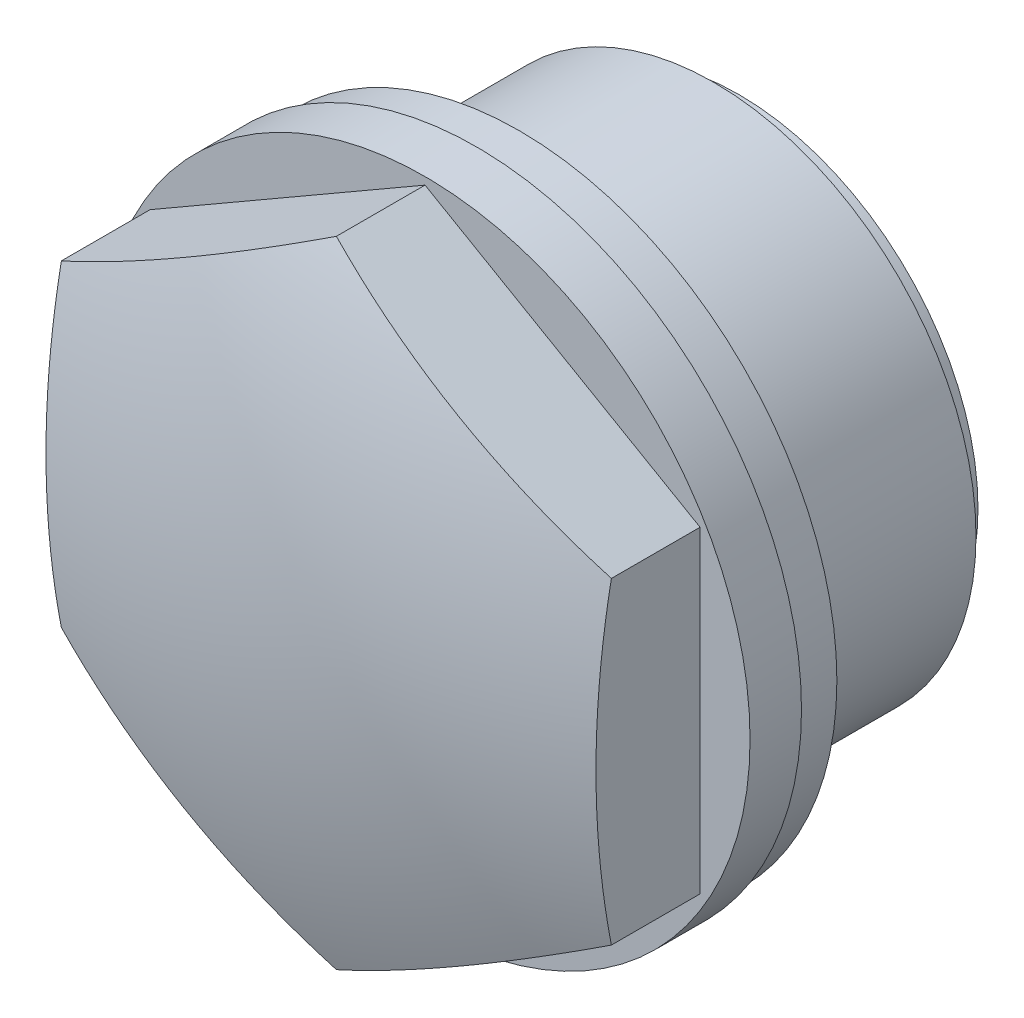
ISO-10303-21;
HEADER;
FILE_DESCRIPTION(('STEP AP214'),'2;1');
FILE_NAME('part.step','',(''),(''),'','','');
FILE_SCHEMA(('AUTOMOTIVE_DESIGN { 1 0 10303 214 1 1 1 1 }'));
ENDSEC;
DATA;
#1=APPLICATION_CONTEXT('core data for automotive mechanical design processes');
#2=APPLICATION_PROTOCOL_DEFINITION('international standard','automotive_design',2000,#1);
#3=PRODUCT_CONTEXT('',#1,'mechanical');
#4=PRODUCT('Part','Part','',(#3));
#5=PRODUCT_RELATED_PRODUCT_CATEGORY('part','',(#4));
#6=PRODUCT_DEFINITION_FORMATION('','',#4);
#7=PRODUCT_DEFINITION_CONTEXT('part definition',#1,'design');
#8=PRODUCT_DEFINITION('design','',#6,#7);
#9=PRODUCT_DEFINITION_SHAPE('','',#8);
#10=(LENGTH_UNIT() NAMED_UNIT(*) SI_UNIT(.MILLI.,.METRE.));
#11=(NAMED_UNIT(*) PLANE_ANGLE_UNIT() SI_UNIT($,.RADIAN.));
#12=(NAMED_UNIT(*) SI_UNIT($,.STERADIAN.) SOLID_ANGLE_UNIT());
#13=UNCERTAINTY_MEASURE_WITH_UNIT(LENGTH_MEASURE(1.E-05),#10,'distance_accuracy_value','');
#14=(GEOMETRIC_REPRESENTATION_CONTEXT(3) GLOBAL_UNCERTAINTY_ASSIGNED_CONTEXT((#13)) GLOBAL_UNIT_ASSIGNED_CONTEXT((#10,
#11,#12)) REPRESENTATION_CONTEXT('',''));
#15=CARTESIAN_POINT('',(0.,0.,0.));
#16=DIRECTION('',(0.,0.,1.));
#17=DIRECTION('',(1.,0.,0.));
#18=AXIS2_PLACEMENT_3D('',#15,#16,#17);
#19=CARTESIAN_POINT('',(0.,0.,9.715));
#20=DIRECTION('',(0.,0.,1.));
#21=DIRECTION('',(1.,0.,0.));
#22=AXIS2_PLACEMENT_3D('',#19,#20,#21);
#23=CYLINDRICAL_SURFACE('',#22,13.);
#24=CARTESIAN_POINT('',(0.,0.,3.77261316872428));
#25=DIRECTION('',(0.,0.,1.));
#26=DIRECTION('',(1.,0.,0.));
#27=AXIS2_PLACEMENT_3D('',#24,#25,#26);
#28=CIRCLE('',#27,13.);
#29=CARTESIAN_POINT('',(13.,0.,3.77261316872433));
#30=VERTEX_POINT('',#29);
#31=EDGE_CURVE('E141',#30,#30,#28,.T.);
#32=ORIENTED_EDGE('',*,*,#31,.F.);
#33=EDGE_LOOP('',(#32));
#34=FACE_BOUND('',#33,.T.);
#35=CARTESIAN_POINT('',(0.,0.,1.715));
#36=DIRECTION('',(0.,0.,1.));
#37=DIRECTION('',(1.,0.,0.));
#38=AXIS2_PLACEMENT_3D('',#35,#36,#37);
#39=CIRCLE('',#38,13.);
#40=CARTESIAN_POINT('',(13.,0.,1.71500000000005));
#41=VERTEX_POINT('',#40);
#42=EDGE_CURVE('E109',#41,#41,#39,.T.);
#43=ORIENTED_EDGE('',*,*,#42,.T.);
#44=EDGE_LOOP('',(#43));
#45=FACE_BOUND('',#44,.T.);
#46=ADVANCED_FACE('F14',(#34,#45),#23,.T.);
#47=CARTESIAN_POINT('',(0.,1.06685493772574E-13,-27.1509999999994));
#48=DIRECTION('',(0.,0.,1.));
#49=DIRECTION('',(0.,-1.,0.));
#50=AXIS2_PLACEMENT_3D('',#47,#48,#49);
#51=SPHERICAL_SURFACE('',#50,34.8659999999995);
#52=CARTESIAN_POINT('',(0.,0.,6.9417508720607));
#53=DIRECTION('',(0.,0.,1.));
#54=DIRECTION('',(1.,0.,0.));
#55=AXIS2_PLACEMENT_3D('',#52,#53,#54);
#56=CIRCLE('',#55,7.30221158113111);
#57=CARTESIAN_POINT('',(7.30221158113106,0.,6.94175087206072));
#58=VERTEX_POINT('',#57);
#59=EDGE_CURVE('E133',#58,#58,#56,.T.);
#60=ORIENTED_EDGE('',*,*,#59,.F.);
#61=EDGE_LOOP('',(#60));
#62=FACE_BOUND('',#61,.T.);
#63=ADVANCED_FACE('F16',(#62),#51,.F.);
#64=CARTESIAN_POINT('',(0.,0.,6.9417508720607));
#65=DIRECTION('',(0.,0.,-1.));
#66=DIRECTION('',(-1.,0.,0.));
#67=AXIS2_PLACEMENT_3D('',#64,#65,#66);
#68=CONICAL_SURFACE('',#67,7.30221158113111,0.0349065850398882);
#69=CARTESIAN_POINT('',(0.,0.,-8.785));
#70=DIRECTION('',(0.,0.,1.));
#71=DIRECTION('',(1.,0.,0.));
#72=AXIS2_PLACEMENT_3D('',#69,#70,#71);
#73=CIRCLE('',#72,7.85140182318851);
#74=CARTESIAN_POINT('',(7.85140182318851,0.,-8.78499999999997));
#75=VERTEX_POINT('',#74);
#76=EDGE_CURVE('E130',#75,#75,#73,.T.);
#77=ORIENTED_EDGE('',*,*,#76,.F.);
#78=EDGE_LOOP('',(#77));
#79=FACE_BOUND('',#78,.T.);
#80=ORIENTED_EDGE('',*,*,#59,.T.);
#81=EDGE_LOOP('',(#80));
#82=FACE_BOUND('',#81,.T.);
#83=ADVANCED_FACE('F172',(#79,#82),#68,.F.);
#84=CARTESIAN_POINT('',(0.,7.85140182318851,-8.785));
#85=DIRECTION('',(0.,0.,1.));
#86=DIRECTION('',(1.,0.,0.));
#87=AXIS2_PLACEMENT_3D('',#84,#85,#86);
#88=PLANE('',#87);
#89=CARTESIAN_POINT('',(0.,0.,-8.785));
#90=DIRECTION('',(0.,0.,1.));
#91=DIRECTION('',(1.,0.,0.));
#92=AXIS2_PLACEMENT_3D('',#89,#90,#91);
#93=CIRCLE('',#92,9.5598475);
#94=CARTESIAN_POINT('',(9.5598475,0.,-8.78499999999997));
#95=VERTEX_POINT('',#94);
#96=EDGE_CURVE('E127',#95,#95,#93,.T.);
#97=ORIENTED_EDGE('',*,*,#96,.F.);
#98=EDGE_LOOP('',(#97));
#99=FACE_BOUND('',#98,.T.);
#100=ORIENTED_EDGE('',*,*,#76,.T.);
#101=EDGE_LOOP('',(#100));
#102=FACE_BOUND('',#101,.T.);
#103=ADVANCED_FACE('F202',(#99,#102),#88,.F.);
#104=CARTESIAN_POINT('',(0.,0.,9.715));
#105=DIRECTION('',(0.,0.,1.));
#106=DIRECTION('',(1.,0.,0.));
#107=AXIS2_PLACEMENT_3D('',#104,#105,#106);
#108=CYLINDRICAL_SURFACE('',#107,9.5598475);
#109=CARTESIAN_POINT('',(0.,0.,-7.785));
#110=DIRECTION('',(0.,0.,1.));
#111=DIRECTION('',(1.,0.,0.));
#112=AXIS2_PLACEMENT_3D('',#109,#110,#111);
#113=CIRCLE('',#112,9.5598475);
#114=CARTESIAN_POINT('',(9.5598475,0.,-7.78499999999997));
#115=VERTEX_POINT('',#114);
#116=EDGE_CURVE('E124',#115,#115,#113,.T.);
#117=ORIENTED_EDGE('',*,*,#116,.F.);
#118=EDGE_LOOP('',(#117));
#119=FACE_BOUND('',#118,.T.);
#120=ORIENTED_EDGE('',*,*,#96,.T.);
#121=EDGE_LOOP('',(#120));
#122=FACE_BOUND('',#121,.T.);
#123=ADVANCED_FACE('F198',(#119,#122),#108,.T.);
#124=CARTESIAN_POINT('',(0.,9.5598475,-7.785));
#125=DIRECTION('',(0.,0.,1.));
#126=DIRECTION('',(1.,0.,0.));
#127=AXIS2_PLACEMENT_3D('',#124,#125,#126);
#128=PLANE('',#127);
#129=CARTESIAN_POINT('',(0.,0.,-7.785));
#130=DIRECTION('',(0.,0.,1.));
#131=DIRECTION('',(1.,0.,0.));
#132=AXIS2_PLACEMENT_3D('',#129,#130,#131);
#133=CIRCLE('',#132,10.48);
#134=CARTESIAN_POINT('',(10.48,0.,-7.78499999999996));
#135=VERTEX_POINT('',#134);
#136=EDGE_CURVE('E121',#135,#135,#133,.T.);
#137=ORIENTED_EDGE('',*,*,#136,.F.);
#138=EDGE_LOOP('',(#137));
#139=FACE_BOUND('',#138,.T.);
#140=ORIENTED_EDGE('',*,*,#116,.T.);
#141=EDGE_LOOP('',(#140));
#142=FACE_BOUND('',#141,.T.);
#143=ADVANCED_FACE('F194',(#139,#142),#128,.F.);
#144=CARTESIAN_POINT('',(0.,0.,9.715));
#145=DIRECTION('',(0.,0.,1.));
#146=DIRECTION('',(1.,0.,0.));
#147=AXIS2_PLACEMENT_3D('',#144,#145,#146);
#148=CYLINDRICAL_SURFACE('',#147,10.48);
#149=CARTESIAN_POINT('',(0.,0.,0.000469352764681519));
#150=DIRECTION('',(0.,0.,1.));
#151=DIRECTION('',(1.,0.,0.));
#152=AXIS2_PLACEMENT_3D('',#149,#150,#151);
#153=CIRCLE('',#152,10.48);
#154=CARTESIAN_POINT('',(10.48,0.,0.00046935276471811));
#155=VERTEX_POINT('',#154);
#156=EDGE_CURVE('E118',#155,#155,#153,.T.);
#157=ORIENTED_EDGE('',*,*,#156,.F.);
#158=EDGE_LOOP('',(#157));
#159=FACE_BOUND('',#158,.T.);
#160=ORIENTED_EDGE('',*,*,#136,.T.);
#161=EDGE_LOOP('',(#160));
#162=FACE_BOUND('',#161,.T.);
#163=ADVANCED_FACE('F190',(#159,#162),#148,.T.);
#164=CARTESIAN_POINT('',(0.,10.48,0.000469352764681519));
#165=DIRECTION('',(0.,0.,1.));
#166=DIRECTION('',(1.,0.,0.));
#167=AXIS2_PLACEMENT_3D('',#164,#165,#166);
#168=PLANE('',#167);
#169=CARTESIAN_POINT('',(0.,0.,0.000469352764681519));
#170=DIRECTION('',(0.,0.,1.));
#171=DIRECTION('',(1.,0.,0.));
#172=AXIS2_PLACEMENT_3D('',#169,#170,#171);
#173=CIRCLE('',#172,12.701);
#174=CARTESIAN_POINT('',(12.701,0.,0.000469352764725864));
#175=VERTEX_POINT('',#174);
#176=EDGE_CURVE('E115',#175,#175,#173,.T.);
#177=ORIENTED_EDGE('',*,*,#176,.F.);
#178=EDGE_LOOP('',(#177));
#179=FACE_BOUND('',#178,.T.);
#180=ORIENTED_EDGE('',*,*,#156,.T.);
#181=EDGE_LOOP('',(#180));
#182=FACE_BOUND('',#181,.T.);
#183=ADVANCED_FACE('F186',(#179,#182),#168,.F.);
#184=CARTESIAN_POINT('',(0.,0.,9.715));
#185=DIRECTION('',(0.,0.,1.));
#186=DIRECTION('',(1.,0.,0.));
#187=AXIS2_PLACEMENT_3D('',#184,#185,#186);
#188=CYLINDRICAL_SURFACE('',#187,12.701);
#189=CARTESIAN_POINT('',(0.,0.,1.715));
#190=DIRECTION('',(0.,0.,1.));
#191=DIRECTION('',(1.,0.,0.));
#192=AXIS2_PLACEMENT_3D('',#189,#190,#191);
#193=CIRCLE('',#192,12.701);
#194=CARTESIAN_POINT('',(12.701,0.,1.71500000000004));
#195=VERTEX_POINT('',#194);
#196=EDGE_CURVE('E112',#195,#195,#193,.T.);
#197=ORIENTED_EDGE('',*,*,#196,.F.);
#198=EDGE_LOOP('',(#197));
#199=FACE_BOUND('',#198,.T.);
#200=ORIENTED_EDGE('',*,*,#176,.T.);
#201=EDGE_LOOP('',(#200));
#202=FACE_BOUND('',#201,.T.);
#203=ADVANCED_FACE('F182',(#199,#202),#188,.T.);
#204=CARTESIAN_POINT('',(0.,12.701,1.715));
#205=DIRECTION('',(0.,0.,1.));
#206=DIRECTION('',(1.,0.,0.));
#207=AXIS2_PLACEMENT_3D('',#204,#205,#206);
#208=PLANE('',#207);
#209=ORIENTED_EDGE('',*,*,#42,.F.);
#210=EDGE_LOOP('',(#209));
#211=FACE_BOUND('',#210,.T.);
#212=ORIENTED_EDGE('',*,*,#196,.T.);
#213=EDGE_LOOP('',(#212));
#214=FACE_BOUND('',#213,.T.);
#215=ADVANCED_FACE('F179',(#211,#214),#208,.F.);
#216=CARTESIAN_POINT('',(0.,0.,-25.151));
#217=DIRECTION('',(0.,0.,1.));
#218=DIRECTION('',(0.,1.,0.));
#219=AXIS2_PLACEMENT_3D('',#216,#217,#218);
#220=SPHERICAL_SURFACE('',#219,34.866);
#221=CARTESIAN_POINT('',(5.5,9.52627944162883,-25.151));
#222=DIRECTION('',(-0.5,-0.866025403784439,0.));
#223=DIRECTION('',(0.866025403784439,-0.5,0.));
#224=AXIS2_PLACEMENT_3D('',#221,#222,#223);
#225=CIRCLE('',#224,33.0853132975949);
#226=CARTESIAN_POINT('',(0.,12.7017059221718,7.3190573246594));
#227=VERTEX_POINT('',#226);
#228=CARTESIAN_POINT('',(11.,6.3508529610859,7.31905732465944));
#229=VERTEX_POINT('',#228);
#230=EDGE_CURVE('E85',#227,#229,#225,.F.);
#231=ORIENTED_EDGE('',*,*,#230,.F.);
#232=CARTESIAN_POINT('',(-5.49999999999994,9.52627944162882,-25.151));
#233=DIRECTION('',(0.5,-0.866025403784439,0.));
#234=DIRECTION('',(0.866025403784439,0.5,0.));
#235=AXIS2_PLACEMENT_3D('',#232,#233,#234);
#236=CIRCLE('',#235,33.0853132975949);
#237=CARTESIAN_POINT('',(-11.,6.35085296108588,7.31905732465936));
#238=VERTEX_POINT('',#237);
#239=EDGE_CURVE('E136',#238,#227,#236,.F.);
#240=ORIENTED_EDGE('',*,*,#239,.F.);
#241=CARTESIAN_POINT('',(-11.,0.,-25.151));
#242=DIRECTION('',(1.,0.,0.));
#243=DIRECTION('',(0.,0.,-1.));
#244=AXIS2_PLACEMENT_3D('',#241,#242,#243);
#245=CIRCLE('',#244,33.0853132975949);
#246=CARTESIAN_POINT('',(-11.,-6.35085296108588,7.31905732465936));
#247=VERTEX_POINT('',#246);
#248=EDGE_CURVE('E36',#247,#238,#245,.F.);
#249=ORIENTED_EDGE('',*,*,#248,.F.);
#250=CARTESIAN_POINT('',(-5.49999999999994,-9.52627944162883,-25.151));
#251=DIRECTION('',(0.5,0.866025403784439,0.));
#252=DIRECTION('',(-0.866025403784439,0.5,0.));
#253=AXIS2_PLACEMENT_3D('',#250,#251,#252);
#254=CIRCLE('',#253,33.0853132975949);
#255=CARTESIAN_POINT('',(0.,-12.7017059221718,7.3190573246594));
#256=VERTEX_POINT('',#255);
#257=EDGE_CURVE('E29',#256,#247,#254,.F.);
#258=ORIENTED_EDGE('',*,*,#257,.F.);
#259=CARTESIAN_POINT('',(5.5,-9.52627944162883,-25.151));
#260=DIRECTION('',(-0.5,0.866025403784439,0.));
#261=DIRECTION('',(-0.866025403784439,-0.5,0.));
#262=AXIS2_PLACEMENT_3D('',#259,#260,#261);
#263=CIRCLE('',#262,33.0853132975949);
#264=CARTESIAN_POINT('',(11.,-6.35085296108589,7.31905732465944));
#265=VERTEX_POINT('',#264);
#266=EDGE_CURVE('E98',#265,#256,#263,.F.);
#267=ORIENTED_EDGE('',*,*,#266,.F.);
#268=CARTESIAN_POINT('',(11.,0.,-25.151));
#269=DIRECTION('',(-1.,0.,0.));
#270=DIRECTION('',(0.,0.,1.));
#271=AXIS2_PLACEMENT_3D('',#268,#269,#270);
#272=CIRCLE('',#271,33.0853132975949);
#273=EDGE_CURVE('E9',#229,#265,#272,.F.);
#274=ORIENTED_EDGE('',*,*,#273,.F.);
#275=EDGE_LOOP('',(#231,#240,#249,#258,#267,#274));
#276=FACE_BOUND('',#275,.T.);
#277=ADVANCED_FACE('F150',(#276),#220,.T.);
#278=CARTESIAN_POINT('',(0.,0.,3.77261316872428));
#279=DIRECTION('',(0.,0.,1.));
#280=DIRECTION('',(1.,0.,0.));
#281=AXIS2_PLACEMENT_3D('',#278,#279,#280);
#282=PLANE('',#281);
#283=ORIENTED_EDGE('',*,*,#31,.T.);
#284=EDGE_LOOP('',(#283));
#285=FACE_BOUND('',#284,.T.);
#286=DIRECTION('',(0.866025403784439,0.5,0.));
#287=VECTOR('',#286,1.);
#288=CARTESIAN_POINT('',(-11.,6.35085296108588,3.77261316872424));
#289=LINE('',#288,#287);
#290=CARTESIAN_POINT('',(-11.,6.35085296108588,3.77261316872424));
#291=VERTEX_POINT('',#290);
#292=CARTESIAN_POINT('',(0.,12.7017059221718,3.77261316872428));
#293=VERTEX_POINT('',#292);
#294=EDGE_CURVE('E77',#291,#293,#289,.T.);
#295=ORIENTED_EDGE('',*,*,#294,.T.);
#296=DIRECTION('',(0.866025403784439,-0.5,0.));
#297=VECTOR('',#296,1.);
#298=CARTESIAN_POINT('',(-0.100000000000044,12.7594409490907,3.77261316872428));
#299=LINE('',#298,#297);
#300=CARTESIAN_POINT('',(11.,6.3508529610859,3.77261316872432));
#301=VERTEX_POINT('',#300);
#302=EDGE_CURVE('E68',#293,#301,#299,.T.);
#303=ORIENTED_EDGE('',*,*,#302,.T.);
#304=DIRECTION('',(0.,-1.,0.));
#305=VECTOR('',#304,1.);
#306=CARTESIAN_POINT('',(11.,6.3508529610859,3.77261316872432));
#307=LINE('',#306,#305);
#308=CARTESIAN_POINT('',(11.,-6.35085296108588,3.77261316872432));
#309=VERTEX_POINT('',#308);
#310=EDGE_CURVE('E73',#301,#309,#307,.T.);
#311=ORIENTED_EDGE('',*,*,#310,.T.);
#312=DIRECTION('',(-0.866025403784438,-0.5,0.));
#313=VECTOR('',#312,1.);
#314=CARTESIAN_POINT('',(11.,-6.35085296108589,3.77261316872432));
#315=LINE('',#314,#313);
#316=CARTESIAN_POINT('',(0.,-12.7017059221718,3.77261316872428));
#317=VERTEX_POINT('',#316);
#318=EDGE_CURVE('E92',#309,#317,#315,.T.);
#319=ORIENTED_EDGE('',*,*,#318,.T.);
#320=DIRECTION('',(-0.866025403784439,0.5,0.));
#321=VECTOR('',#320,1.);
#322=CARTESIAN_POINT('',(0.0999999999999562,-12.7594409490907,3.77261316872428));
#323=LINE('',#322,#321);
#324=CARTESIAN_POINT('',(-11.,-6.35085296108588,3.77261316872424));
#325=VERTEX_POINT('',#324);
#326=EDGE_CURVE('E100',#317,#325,#323,.T.);
#327=ORIENTED_EDGE('',*,*,#326,.T.);
#328=DIRECTION('',(0.,1.,0.));
#329=VECTOR('',#328,1.);
#330=CARTESIAN_POINT('',(-11.,-6.35085296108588,3.77261316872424));
#331=LINE('',#330,#329);
#332=EDGE_CURVE('E102',#325,#291,#331,.T.);
#333=ORIENTED_EDGE('',*,*,#332,.T.);
#334=EDGE_LOOP('',(#295,#303,#311,#319,#327,#333));
#335=FACE_BOUND('',#334,.T.);
#336=ADVANCED_FACE('F70',(#285,#335),#282,.T.);
#337=CARTESIAN_POINT('',(0.0999999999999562,-12.7594409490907,3.77261316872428));
#338=DIRECTION('',(0.5,0.866025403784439,0.));
#339=DIRECTION('',(-0.866025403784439,0.5,0.));
#340=AXIS2_PLACEMENT_3D('',#337,#338,#339);
#341=PLANE('',#340);
#342=ORIENTED_EDGE('',*,*,#326,.F.);
#343=DIRECTION('',(0.,0.,1.));
#344=VECTOR('',#343,1.);
#345=CARTESIAN_POINT('',(0.,-12.7017059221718,3.77261316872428));
#346=LINE('',#345,#344);
#347=EDGE_CURVE('E22',#317,#256,#346,.T.);
#348=ORIENTED_EDGE('',*,*,#347,.T.);
#349=ORIENTED_EDGE('',*,*,#257,.T.);
#350=DIRECTION('',(0.,0.,1.));
#351=VECTOR('',#350,1.);
#352=CARTESIAN_POINT('',(-11.,-6.35085296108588,3.77261316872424));
#353=LINE('',#352,#351);
#354=EDGE_CURVE('E107',#325,#247,#353,.T.);
#355=ORIENTED_EDGE('',*,*,#354,.F.);
#356=EDGE_LOOP('',(#342,#348,#349,#355));
#357=FACE_BOUND('',#356,.T.);
#358=ADVANCED_FACE('F146',(#357),#341,.F.);
#359=CARTESIAN_POINT('',(-11.,-6.35085296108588,3.77261316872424));
#360=DIRECTION('',(1.,0.,0.));
#361=DIRECTION('',(0.,0.,-1.));
#362=AXIS2_PLACEMENT_3D('',#359,#360,#361);
#363=PLANE('',#362);
#364=ORIENTED_EDGE('',*,*,#248,.T.);
#365=DIRECTION('',(0.,0.,1.));
#366=VECTOR('',#365,1.);
#367=CARTESIAN_POINT('',(-11.,6.35085296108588,3.77261316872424));
#368=LINE('',#367,#366);
#369=EDGE_CURVE('E105',#291,#238,#368,.T.);
#370=ORIENTED_EDGE('',*,*,#369,.F.);
#371=ORIENTED_EDGE('',*,*,#332,.F.);
#372=ORIENTED_EDGE('',*,*,#354,.T.);
#373=EDGE_LOOP('',(#364,#370,#371,#372));
#374=FACE_BOUND('',#373,.T.);
#375=ADVANCED_FACE('F155',(#374),#363,.F.);
#376=CARTESIAN_POINT('',(-11.,6.35085296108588,3.77261316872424));
#377=DIRECTION('',(0.5,-0.866025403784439,0.));
#378=DIRECTION('',(0.866025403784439,0.5,0.));
#379=AXIS2_PLACEMENT_3D('',#376,#377,#378);
#380=PLANE('',#379);
#381=ORIENTED_EDGE('',*,*,#239,.T.);
#382=DIRECTION('',(0.,0.,-1.));
#383=VECTOR('',#382,1.);
#384=CARTESIAN_POINT('',(0.,12.7017059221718,3.77261316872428));
#385=LINE('',#384,#383);
#386=EDGE_CURVE('E144',#227,#293,#385,.T.);
#387=ORIENTED_EDGE('',*,*,#386,.T.);
#388=ORIENTED_EDGE('',*,*,#294,.F.);
#389=ORIENTED_EDGE('',*,*,#369,.T.);
#390=EDGE_LOOP('',(#381,#387,#388,#389));
#391=FACE_BOUND('',#390,.T.);
#392=ADVANCED_FACE('F153',(#391),#380,.F.);
#393=CARTESIAN_POINT('',(-0.100000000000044,12.7594409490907,3.77261316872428));
#394=DIRECTION('',(-0.5,-0.866025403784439,0.));
#395=DIRECTION('',(0.866025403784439,-0.5,0.));
#396=AXIS2_PLACEMENT_3D('',#393,#394,#395);
#397=PLANE('',#396);
#398=ORIENTED_EDGE('',*,*,#230,.T.);
#399=DIRECTION('',(0.,0.,1.));
#400=VECTOR('',#399,1.);
#401=CARTESIAN_POINT('',(11.,6.3508529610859,3.77261316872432));
#402=LINE('',#401,#400);
#403=EDGE_CURVE('E82',#301,#229,#402,.T.);
#404=ORIENTED_EDGE('',*,*,#403,.F.);
#405=ORIENTED_EDGE('',*,*,#302,.F.);
#406=ORIENTED_EDGE('',*,*,#386,.F.);
#407=EDGE_LOOP('',(#398,#404,#405,#406));
#408=FACE_BOUND('',#407,.T.);
#409=ADVANCED_FACE('F83',(#408),#397,.F.);
#410=CARTESIAN_POINT('',(11.,6.3508529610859,3.77261316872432));
#411=DIRECTION('',(-1.,0.,0.));
#412=DIRECTION('',(0.,0.,1.));
#413=AXIS2_PLACEMENT_3D('',#410,#411,#412);
#414=PLANE('',#413);
#415=ORIENTED_EDGE('',*,*,#273,.T.);
#416=DIRECTION('',(0.,0.,1.));
#417=VECTOR('',#416,1.);
#418=CARTESIAN_POINT('',(11.,-6.35085296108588,3.77261316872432));
#419=LINE('',#418,#417);
#420=EDGE_CURVE('E88',#309,#265,#419,.T.);
#421=ORIENTED_EDGE('',*,*,#420,.F.);
#422=ORIENTED_EDGE('',*,*,#310,.F.);
#423=ORIENTED_EDGE('',*,*,#403,.T.);
#424=EDGE_LOOP('',(#415,#421,#422,#423));
#425=FACE_BOUND('',#424,.T.);
#426=ADVANCED_FACE('F90',(#425),#414,.F.);
#427=CARTESIAN_POINT('',(11.,-6.35085296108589,3.77261316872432));
#428=DIRECTION('',(-0.5,0.866025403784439,0.));
#429=DIRECTION('',(-0.866025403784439,-0.5,0.));
#430=AXIS2_PLACEMENT_3D('',#427,#428,#429);
#431=PLANE('',#430);
#432=ORIENTED_EDGE('',*,*,#266,.T.);
#433=ORIENTED_EDGE('',*,*,#347,.F.);
#434=ORIENTED_EDGE('',*,*,#318,.F.);
#435=ORIENTED_EDGE('',*,*,#420,.T.);
#436=EDGE_LOOP('',(#432,#433,#434,#435));
#437=FACE_BOUND('',#436,.T.);
#438=ADVANCED_FACE('F156',(#437),#431,.F.);
#439=CLOSED_SHELL('',(#46,#63,#83,#103,#123,#143,#163,#183,#203,#215,#277,#336,#358,#375,#392,
#409,#426,#438));
#440=MANIFOLD_SOLID_BREP('B1',#439);
#441=ADVANCED_BREP_SHAPE_REPRESENTATION('',(#18,#440),#14);
#442=SHAPE_DEFINITION_REPRESENTATION(#9,#441);
ENDSEC;
END-ISO-10303-21;
